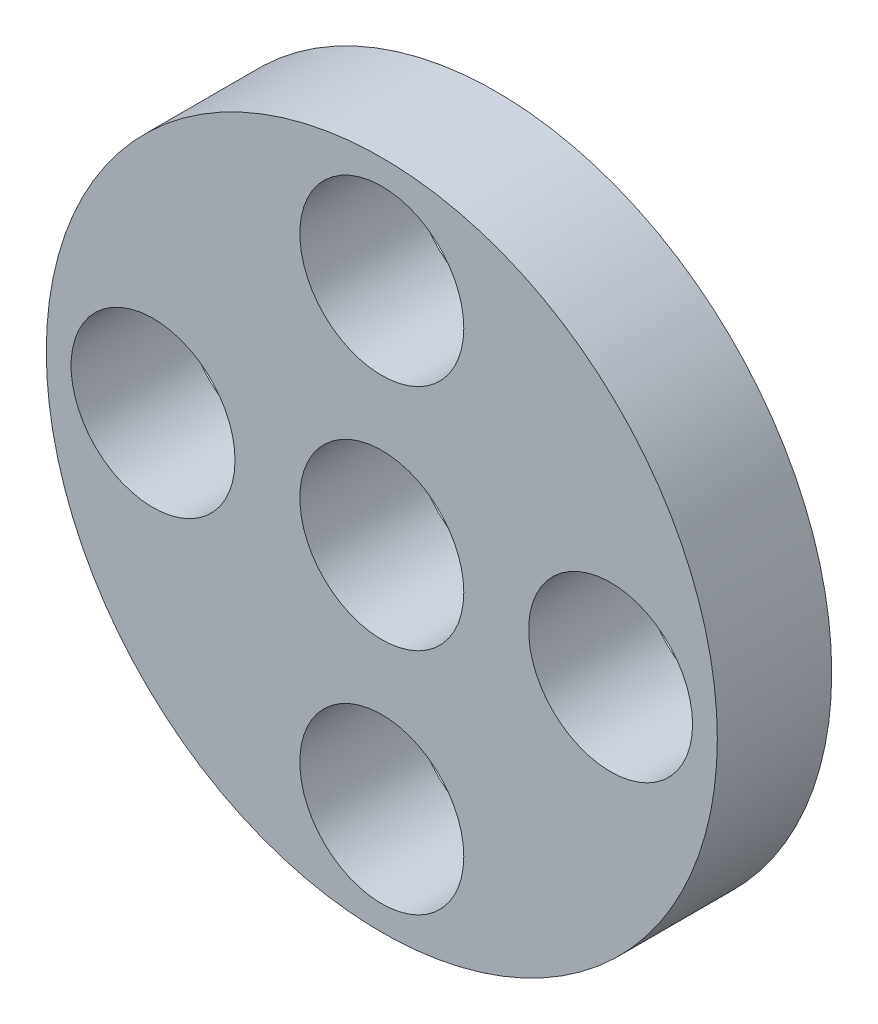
from build123d import *

# Parameters (mm, degrees)
SKETCH1_R           = 8.8
SKETCH1_R_2         = 2.15
BOSS_EXTRUDE1_DEPTH = 3


with BuildPart() as part:
    # Sketch1 → Boss-Extrude1 (new body)
    with BuildSketch(Plane.XY):
        Circle(SKETCH1_R)
        with Locations((0, 6)):
            Circle(SKETCH1_R_2, mode=Mode.SUBTRACT)
        with Locations((6, 0)):
            Circle(SKETCH1_R_2, mode=Mode.SUBTRACT)
        with Locations((0, -6)):
            Circle(SKETCH1_R_2, mode=Mode.SUBTRACT)
        with Locations((-6, 0)):
            Circle(SKETCH1_R_2, mode=Mode.SUBTRACT)
        Circle(SKETCH1_R_2, mode=Mode.SUBTRACT)
    extrude(amount=BOSS_EXTRUDE1_DEPTH)


solid = part.part
